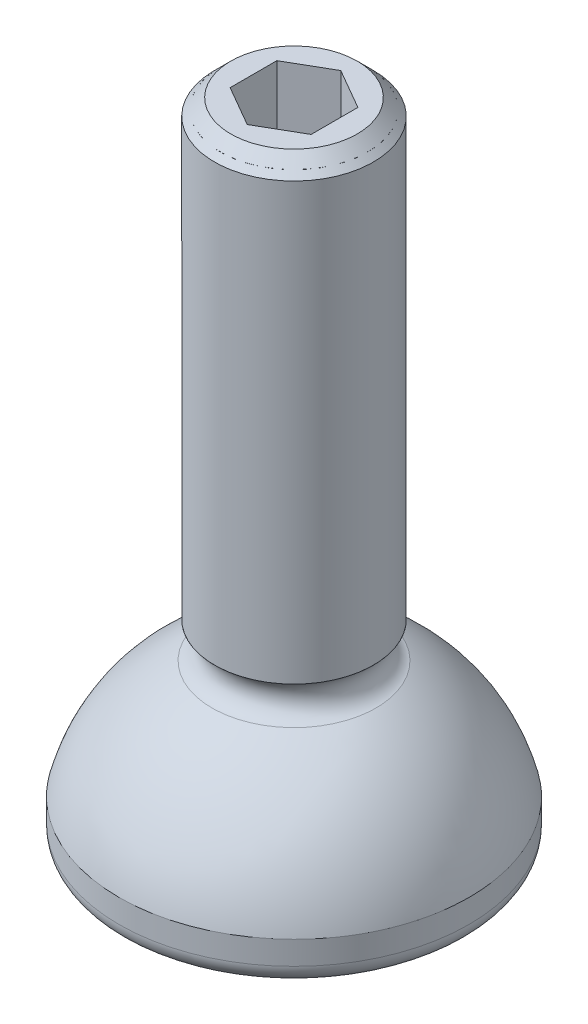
ISO-10303-21;
HEADER;
FILE_DESCRIPTION(('STEP AP214'),'2;1');
FILE_NAME('part.step','',(''),(''),'','','');
FILE_SCHEMA(('AUTOMOTIVE_DESIGN { 1 0 10303 214 1 1 1 1 }'));
ENDSEC;
DATA;
#1=APPLICATION_CONTEXT('core data for automotive mechanical design processes');
#2=APPLICATION_PROTOCOL_DEFINITION('international standard','automotive_design',2000,#1);
#3=PRODUCT_CONTEXT('',#1,'mechanical');
#4=PRODUCT('Part','Part','',(#3));
#5=PRODUCT_RELATED_PRODUCT_CATEGORY('part','',(#4));
#6=PRODUCT_DEFINITION_FORMATION('','',#4);
#7=PRODUCT_DEFINITION_CONTEXT('part definition',#1,'design');
#8=PRODUCT_DEFINITION('design','',#6,#7);
#9=PRODUCT_DEFINITION_SHAPE('','',#8);
#10=(LENGTH_UNIT() NAMED_UNIT(*) SI_UNIT(.MILLI.,.METRE.));
#11=(NAMED_UNIT(*) PLANE_ANGLE_UNIT() SI_UNIT($,.RADIAN.));
#12=(NAMED_UNIT(*) SI_UNIT($,.STERADIAN.) SOLID_ANGLE_UNIT());
#13=UNCERTAINTY_MEASURE_WITH_UNIT(LENGTH_MEASURE(1.E-05),#10,'distance_accuracy_value','');
#14=(GEOMETRIC_REPRESENTATION_CONTEXT(3) GLOBAL_UNCERTAINTY_ASSIGNED_CONTEXT((#13)) GLOBAL_UNIT_ASSIGNED_CONTEXT((#10,
#11,#12)) REPRESENTATION_CONTEXT('',''));
#15=CARTESIAN_POINT('',(0.,0.,0.));
#16=DIRECTION('',(0.,0.,1.));
#17=DIRECTION('',(1.,0.,0.));
#18=AXIS2_PLACEMENT_3D('',#15,#16,#17);
#19=CARTESIAN_POINT('',(0.,27.9400000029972,0.));
#20=DIRECTION('',(0.,-1.,0.));
#21=DIRECTION('',(0.,0.,-1.));
#22=AXIS2_PLACEMENT_3D('',#19,#20,#21);
#23=CYLINDRICAL_SURFACE('',#22,2.8829);
#24=CARTESIAN_POINT('',(0.,7.69088775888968,0.));
#25=DIRECTION('',(0.,-1.,0.));
#26=DIRECTION('',(0.,0.,-1.));
#27=AXIS2_PLACEMENT_3D('',#24,#25,#26);
#28=CIRCLE('',#27,2.8829);
#29=CARTESIAN_POINT('',(0.,7.69088775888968,-2.8829));
#30=VERTEX_POINT('',#29);
#31=EDGE_CURVE('P0_E21',#30,#30,#28,.F.);
#32=ORIENTED_EDGE('',*,*,#31,.T.);
#33=EDGE_LOOP('',(#32));
#34=FACE_BOUND('',#33,.T.);
#35=CARTESIAN_POINT('',(0.,24.9936,0.));
#36=DIRECTION('',(0.,-1.,0.));
#37=DIRECTION('',(0.,0.,-1.));
#38=AXIS2_PLACEMENT_3D('',#35,#36,#37);
#39=CIRCLE('',#38,2.8829);
#40=CARTESIAN_POINT('',(0.,24.9936,-2.8829));
#41=VERTEX_POINT('',#40);
#42=EDGE_CURVE('P0_E11',#41,#41,#39,.T.);
#43=ORIENTED_EDGE('',*,*,#42,.T.);
#44=EDGE_LOOP('',(#43));
#45=FACE_BOUND('',#44,.T.);
#46=ADVANCED_FACE('P0_F17',(#34,#45),#23,.T.);
#47=CARTESIAN_POINT('',(0.,7.69088775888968,0.));
#48=DIRECTION('',(0.,-1.,0.));
#49=DIRECTION('',(0.,0.,-1.));
#50=AXIS2_PLACEMENT_3D('',#47,#48,#49);
#51=PLANE('',#50);
#52=ORIENTED_EDGE('',*,*,#31,.F.);
#53=EDGE_LOOP('',(#52));
#54=FACE_BOUND('',#53,.T.);
#55=CARTESIAN_POINT('',(3.1115,7.69088775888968,0.));
#56=CARTESIAN_POINT('',(3.11129758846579,7.69088775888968,0.593742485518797));
#57=CARTESIAN_POINT('',(2.89303629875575,7.69088775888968,1.14532668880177));
#58=CARTESIAN_POINT('',(2.65612503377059,7.69088775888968,1.74404262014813));
#59=CARTESIAN_POINT('',(2.20016274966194,7.69088775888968,2.20016274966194));
#60=CARTESIAN_POINT('',(1.74494552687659,7.69088775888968,2.65553755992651));
#61=CARTESIAN_POINT('',(1.14532668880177,7.69088775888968,2.89303629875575));
#62=CARTESIAN_POINT('',(0.594021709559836,7.69088775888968,3.11139874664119));
#63=CARTESIAN_POINT('',(0.,7.69088775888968,3.1115));
#64=CARTESIAN_POINT('',(-0.592975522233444,7.69088775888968,3.11160107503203));
#65=CARTESIAN_POINT('',(-1.14532668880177,7.69088775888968,2.89303629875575));
#66=CARTESIAN_POINT('',(-1.74404262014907,7.69088775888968,2.65612503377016));
#67=CARTESIAN_POINT('',(-2.20016274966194,7.69088775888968,2.20016274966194));
#68=CARTESIAN_POINT('',(-2.65553755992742,7.69088775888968,1.74494552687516));
#69=CARTESIAN_POINT('',(-2.89303629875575,7.69088775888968,1.14532668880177));
#70=CARTESIAN_POINT('',(-3.11129740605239,7.69088775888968,0.59427756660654));
#71=CARTESIAN_POINT('',(-3.1115,7.69088775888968,0.));
#72=B_SPLINE_CURVE_WITH_KNOTS('',2,(#55,#56,#57,#58,#59,#60,#61,#62,#63,#64,#65,#66,#67,#68,#69,
#70,#71),.UNSPECIFIED.,.F.,.F.,(3,2,2,2,2,2,2,2,3),(0.,0.125,0.25,0.375,0.5,0.625,0.75,0.875,
1.),.UNSPECIFIED.);
#73=CARTESIAN_POINT('',(3.1115,7.69088775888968,0.));
#74=VERTEX_POINT('',#73);
#75=CARTESIAN_POINT('',(-3.1115,7.69088775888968,0.));
#76=VERTEX_POINT('',#75);
#77=EDGE_CURVE('P0_E29',#74,#76,#72,.T.);
#78=ORIENTED_EDGE('',*,*,#77,.F.);
#79=CARTESIAN_POINT('',(-3.1115,7.69088775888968,0.));
#80=CARTESIAN_POINT('',(-3.11129758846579,7.69088775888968,-0.593742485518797));
#81=CARTESIAN_POINT('',(-2.89303629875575,7.69088775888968,-1.14532668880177));
#82=CARTESIAN_POINT('',(-2.65612503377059,7.69088775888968,-1.74404262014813));
#83=CARTESIAN_POINT('',(-2.20016274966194,7.69088775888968,-2.20016274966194));
#84=CARTESIAN_POINT('',(-1.74494552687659,7.69088775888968,-2.65553755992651));
#85=CARTESIAN_POINT('',(-1.14532668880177,7.69088775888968,-2.89303629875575));
#86=CARTESIAN_POINT('',(-0.594021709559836,7.69088775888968,-3.11139874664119));
#87=CARTESIAN_POINT('',(0.,7.69088775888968,-3.1115));
#88=CARTESIAN_POINT('',(0.592975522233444,7.69088775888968,-3.11160107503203));
#89=CARTESIAN_POINT('',(1.14532668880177,7.69088775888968,-2.89303629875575));
#90=CARTESIAN_POINT('',(1.74404262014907,7.69088775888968,-2.65612503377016));
#91=CARTESIAN_POINT('',(2.20016274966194,7.69088775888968,-2.20016274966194));
#92=CARTESIAN_POINT('',(2.65553755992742,7.69088775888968,-1.74494552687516));
#93=CARTESIAN_POINT('',(2.89303629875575,7.69088775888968,-1.14532668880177));
#94=CARTESIAN_POINT('',(3.11129740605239,7.69088775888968,-0.59427756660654));
#95=CARTESIAN_POINT('',(3.1115,7.69088775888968,0.));
#96=B_SPLINE_CURVE_WITH_KNOTS('',2,(#79,#80,#81,#82,#83,#84,#85,#86,#87,#88,#89,#90,#91,#92,#93,
#94,#95),.UNSPECIFIED.,.F.,.F.,(3,2,2,2,2,2,2,2,3),(0.,0.125,0.25,0.375,0.5,0.625,0.75,0.875,
1.),.UNSPECIFIED.);
#97=EDGE_CURVE('P0_E33',#76,#74,#96,.T.);
#98=ORIENTED_EDGE('',*,*,#97,.F.);
#99=EDGE_LOOP('',(#78,#98));
#100=FACE_BOUND('',#99,.T.);
#101=ADVANCED_FACE('P0_F18',(#54,#100),#51,.F.);
#102=OPEN_SHELL('',(#46,#101));
#103=SHELL_BASED_SURFACE_MODEL('P0_B1',(#102));
#104=CARTESIAN_POINT('',(0.,20.5740000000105,0.));
#105=DIRECTION('',(0.,1.,0.));
#106=DIRECTION('',(0.,0.,1.));
#107=AXIS2_PLACEMENT_3D('',#104,#105,#106);
#108=CONICAL_SURFACE('',#107,1.58750000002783,1.02974425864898);
#109=CARTESIAN_POINT('',(1.4210854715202E-10,19.6201337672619,0.));
#110=VERTEX_POINT('',#109);
#111=VERTEX_LOOP('',#110);
#112=FACE_BOUND('',#111,.T.);
#113=CARTESIAN_POINT('',(0.,20.574,0.));
#114=DIRECTION('',(0.,1.,0.));
#115=DIRECTION('',(0.,0.,1.));
#116=AXIS2_PLACEMENT_3D('',#113,#114,#115);
#117=CIRCLE('',#116,1.5875);
#118=CARTESIAN_POINT('',(0.,20.574,1.5875));
#119=VERTEX_POINT('',#118);
#120=EDGE_CURVE('P1_E147',#119,#119,#117,.T.);
#121=ORIENTED_EDGE('',*,*,#120,.T.);
#122=EDGE_LOOP('',(#121));
#123=FACE_BOUND('',#122,.T.);
#124=ADVANCED_FACE('P1_F17',(#112,#123),#108,.F.);
#125=CARTESIAN_POINT('',(0.,19.331140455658,0.));
#126=DIRECTION('',(0.,1.,0.));
#127=DIRECTION('',(0.,0.,1.));
#128=AXIS2_PLACEMENT_3D('',#125,#126,#127);
#129=CYLINDRICAL_SURFACE('',#128,1.5875);
#130=ORIENTED_EDGE('',*,*,#120,.F.);
#131=EDGE_LOOP('',(#130));
#132=FACE_BOUND('',#131,.T.);
#133=CARTESIAN_POINT('',(0.,22.098,0.));
#134=DIRECTION('',(0.,1.,0.));
#135=DIRECTION('',(0.,0.,1.));
#136=AXIS2_PLACEMENT_3D('',#133,#134,#135);
#137=CIRCLE('',#136,1.5875);
#138=CARTESIAN_POINT('',(-1.5875,22.098,0.));
#139=VERTEX_POINT('',#138);
#140=CARTESIAN_POINT('',(-0.793749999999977,22.098,-1.37481532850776));
#141=VERTEX_POINT('',#140);
#142=EDGE_CURVE('P1_E126',#139,#141,#137,.F.);
#143=ORIENTED_EDGE('',*,*,#142,.F.);
#144=CARTESIAN_POINT('',(0.,22.098,0.));
#145=DIRECTION('',(0.,1.,0.));
#146=DIRECTION('',(0.,0.,1.));
#147=AXIS2_PLACEMENT_3D('',#144,#145,#146);
#148=CIRCLE('',#147,1.5875);
#149=CARTESIAN_POINT('',(-0.793749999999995,22.098,1.37481532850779));
#150=VERTEX_POINT('',#149);
#151=EDGE_CURVE('P1_E102',#150,#139,#148,.F.);
#152=ORIENTED_EDGE('',*,*,#151,.F.);
#153=CARTESIAN_POINT('',(0.,22.098,0.));
#154=DIRECTION('',(0.,1.,0.));
#155=DIRECTION('',(0.,0.,1.));
#156=AXIS2_PLACEMENT_3D('',#153,#154,#155);
#157=CIRCLE('',#156,1.5875);
#158=CARTESIAN_POINT('',(0.793749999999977,22.098,1.37481532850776));
#159=VERTEX_POINT('',#158);
#160=EDGE_CURVE('P1_E96',#159,#150,#157,.F.);
#161=ORIENTED_EDGE('',*,*,#160,.F.);
#162=CARTESIAN_POINT('',(0.,22.098,0.));
#163=DIRECTION('',(0.,1.,0.));
#164=DIRECTION('',(0.,0.,1.));
#165=AXIS2_PLACEMENT_3D('',#162,#163,#164);
#166=CIRCLE('',#165,1.5875);
#167=CARTESIAN_POINT('',(1.5875,22.098,0.));
#168=VERTEX_POINT('',#167);
#169=EDGE_CURVE('P1_E111',#168,#159,#166,.F.);
#170=ORIENTED_EDGE('',*,*,#169,.F.);
#171=CARTESIAN_POINT('',(0.,22.098,0.));
#172=DIRECTION('',(0.,1.,0.));
#173=DIRECTION('',(0.,0.,1.));
#174=AXIS2_PLACEMENT_3D('',#171,#172,#173);
#175=CIRCLE('',#174,1.5875);
#176=CARTESIAN_POINT('',(0.793749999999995,22.098,-1.37481532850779));
#177=VERTEX_POINT('',#176);
#178=EDGE_CURVE('P1_E137',#177,#168,#175,.F.);
#179=ORIENTED_EDGE('',*,*,#178,.F.);
#180=CARTESIAN_POINT('',(0.,22.098,0.));
#181=DIRECTION('',(0.,1.,0.));
#182=DIRECTION('',(0.,0.,1.));
#183=AXIS2_PLACEMENT_3D('',#180,#181,#182);
#184=CIRCLE('',#183,1.5875);
#185=EDGE_CURVE('P1_E133',#141,#177,#184,.F.);
#186=ORIENTED_EDGE('',*,*,#185,.F.);
#187=EDGE_LOOP('',(#143,#152,#161,#170,#179,#186));
#188=FACE_BOUND('',#187,.T.);
#189=ADVANCED_FACE('P1_F131',(#132,#188),#129,.F.);
#190=CARTESIAN_POINT('',(0.,0.,0.));
#191=DIRECTION('',(0.,-1.,0.));
#192=DIRECTION('',(0.,0.,-1.));
#193=AXIS2_PLACEMENT_3D('',#190,#191,#192);
#194=PLANE('',#193);
#195=CARTESIAN_POINT('',(0.,0.,0.));
#196=DIRECTION('',(0.,1.,0.));
#197=DIRECTION('',(-1.,0.,0.));
#198=AXIS2_PLACEMENT_3D('',#195,#196,#197);
#199=CIRCLE('',#198,6.096);
#200=CARTESIAN_POINT('',(-6.096,0.,0.));
#201=VERTEX_POINT('',#200);
#202=CARTESIAN_POINT('',(6.096,0.,0.));
#203=VERTEX_POINT('',#202);
#204=EDGE_CURVE('P1_E145',#201,#203,#199,.T.);
#205=ORIENTED_EDGE('',*,*,#204,.F.);
#206=CARTESIAN_POINT('',(0.,0.,0.));
#207=DIRECTION('',(0.,1.,0.));
#208=DIRECTION('',(1.,0.,0.));
#209=AXIS2_PLACEMENT_3D('',#206,#207,#208);
#210=CIRCLE('',#209,6.096);
#211=EDGE_CURVE('P1_E129',#203,#201,#210,.T.);
#212=ORIENTED_EDGE('',*,*,#211,.F.);
#213=EDGE_LOOP('',(#205,#212));
#214=FACE_BOUND('',#213,.T.);
#215=ADVANCED_FACE('P1_F156',(#214),#194,.T.);
#216=CARTESIAN_POINT('',(0.,22.098,0.));
#217=DIRECTION('',(0.,1.,0.));
#218=DIRECTION('',(0.,0.,1.));
#219=AXIS2_PLACEMENT_3D('',#216,#217,#218);
#220=PLANE('',#219);
#221=DIRECTION('',(0.866025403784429,0.,0.500000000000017));
#222=VECTOR('',#221,1.);
#223=CARTESIAN_POINT('',(-1.5875,22.098,0.91654355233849));
#224=LINE('',#223,#222);
#225=CARTESIAN_POINT('',(-1.5875,22.098,0.91654355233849));
#226=VERTEX_POINT('',#225);
#227=EDGE_CURVE('P1_E108',#226,#150,#224,.T.);
#228=ORIENTED_EDGE('',*,*,#227,.T.);
#229=ORIENTED_EDGE('',*,*,#151,.T.);
#230=DIRECTION('',(0.,0.,1.));
#231=VECTOR('',#230,1.);
#232=CARTESIAN_POINT('',(-1.5875,22.098,-0.91654355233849));
#233=LINE('',#232,#231);
#234=EDGE_CURVE('P1_E105',#139,#226,#233,.T.);
#235=ORIENTED_EDGE('',*,*,#234,.T.);
#236=EDGE_LOOP('',(#228,#229,#235));
#237=FACE_BOUND('',#236,.T.);
#238=ADVANCED_FACE('P1_F104',(#237),#220,.T.);
#239=CARTESIAN_POINT('',(0.,22.098,0.));
#240=DIRECTION('',(0.,1.,0.));
#241=DIRECTION('',(0.,0.,1.));
#242=AXIS2_PLACEMENT_3D('',#239,#240,#241);
#243=PLANE('',#242);
#244=DIRECTION('',(0.866025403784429,0.,-0.500000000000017));
#245=VECTOR('',#244,1.);
#246=CARTESIAN_POINT('',(0.,22.098,1.83308710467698));
#247=LINE('',#246,#245);
#248=CARTESIAN_POINT('',(0.,22.098,1.833087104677));
#249=VERTEX_POINT('',#248);
#250=EDGE_CURVE('P1_E307',#249,#159,#247,.T.);
#251=ORIENTED_EDGE('',*,*,#250,.T.);
#252=ORIENTED_EDGE('',*,*,#160,.T.);
#253=DIRECTION('',(0.866025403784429,0.,0.500000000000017));
#254=VECTOR('',#253,1.);
#255=CARTESIAN_POINT('',(-1.5875,22.098,0.91654355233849));
#256=LINE('',#255,#254);
#257=EDGE_CURVE('P1_E320',#150,#249,#256,.T.);
#258=ORIENTED_EDGE('',*,*,#257,.T.);
#259=EDGE_LOOP('',(#251,#252,#258));
#260=FACE_BOUND('',#259,.T.);
#261=ADVANCED_FACE('P1_F368',(#260),#243,.T.);
#262=CARTESIAN_POINT('',(0.,22.098,0.));
#263=DIRECTION('',(0.,1.,0.));
#264=DIRECTION('',(0.,0.,1.));
#265=AXIS2_PLACEMENT_3D('',#262,#263,#264);
#266=PLANE('',#265);
#267=DIRECTION('',(0.,0.,-1.));
#268=VECTOR('',#267,1.);
#269=CARTESIAN_POINT('',(1.5875,22.098,0.91654355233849));
#270=LINE('',#269,#268);
#271=CARTESIAN_POINT('',(1.58749999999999,22.098,0.91654355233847));
#272=VERTEX_POINT('',#271);
#273=EDGE_CURVE('P1_E289',#272,#168,#270,.T.);
#274=ORIENTED_EDGE('',*,*,#273,.T.);
#275=ORIENTED_EDGE('',*,*,#169,.T.);
#276=DIRECTION('',(0.866025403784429,0.,-0.500000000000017));
#277=VECTOR('',#276,1.);
#278=CARTESIAN_POINT('',(0.,22.098,1.83308710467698));
#279=LINE('',#278,#277);
#280=EDGE_CURVE('P1_E303',#159,#272,#279,.T.);
#281=ORIENTED_EDGE('',*,*,#280,.T.);
#282=EDGE_LOOP('',(#274,#275,#281));
#283=FACE_BOUND('',#282,.T.);
#284=ADVANCED_FACE('P1_F352',(#283),#266,.T.);
#285=CARTESIAN_POINT('',(0.,22.098,0.));
#286=DIRECTION('',(0.,1.,0.));
#287=DIRECTION('',(0.,0.,1.));
#288=AXIS2_PLACEMENT_3D('',#285,#286,#287);
#289=PLANE('',#288);
#290=DIRECTION('',(-0.866025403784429,0.,-0.500000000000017));
#291=VECTOR('',#290,1.);
#292=CARTESIAN_POINT('',(1.5875,22.098,-0.91654355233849));
#293=LINE('',#292,#291);
#294=CARTESIAN_POINT('',(1.5875,22.098,-0.91654355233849));
#295=VERTEX_POINT('',#294);
#296=EDGE_CURVE('P1_E266',#295,#177,#293,.T.);
#297=ORIENTED_EDGE('',*,*,#296,.T.);
#298=ORIENTED_EDGE('',*,*,#178,.T.);
#299=DIRECTION('',(0.,0.,-1.));
#300=VECTOR('',#299,1.);
#301=CARTESIAN_POINT('',(1.5875,22.098,0.91654355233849));
#302=LINE('',#301,#300);
#303=EDGE_CURVE('P1_E285',#168,#295,#302,.T.);
#304=ORIENTED_EDGE('',*,*,#303,.T.);
#305=EDGE_LOOP('',(#297,#298,#304));
#306=FACE_BOUND('',#305,.T.);
#307=ADVANCED_FACE('P1_F355',(#306),#289,.T.);
#308=CARTESIAN_POINT('',(0.,22.098,0.));
#309=DIRECTION('',(0.,1.,0.));
#310=DIRECTION('',(0.,0.,1.));
#311=AXIS2_PLACEMENT_3D('',#308,#309,#310);
#312=PLANE('',#311);
#313=DIRECTION('',(-0.866025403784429,0.,0.500000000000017));
#314=VECTOR('',#313,1.);
#315=CARTESIAN_POINT('',(0.,22.098,-1.83308710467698));
#316=LINE('',#315,#314);
#317=CARTESIAN_POINT('',(0.,22.098,-1.833087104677));
#318=VERTEX_POINT('',#317);
#319=EDGE_CURVE('P1_E248',#318,#141,#316,.T.);
#320=ORIENTED_EDGE('',*,*,#319,.T.);
#321=ORIENTED_EDGE('',*,*,#185,.T.);
#322=DIRECTION('',(-0.866025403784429,0.,-0.500000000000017));
#323=VECTOR('',#322,1.);
#324=CARTESIAN_POINT('',(1.5875,22.098,-0.91654355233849));
#325=LINE('',#324,#323);
#326=EDGE_CURVE('P1_E262',#177,#318,#325,.T.);
#327=ORIENTED_EDGE('',*,*,#326,.T.);
#328=EDGE_LOOP('',(#320,#321,#327));
#329=FACE_BOUND('',#328,.T.);
#330=ADVANCED_FACE('P1_F358',(#329),#312,.T.);
#331=CARTESIAN_POINT('',(0.,22.098,0.));
#332=DIRECTION('',(0.,1.,0.));
#333=DIRECTION('',(0.,0.,1.));
#334=AXIS2_PLACEMENT_3D('',#331,#332,#333);
#335=PLANE('',#334);
#336=DIRECTION('',(0.,0.,1.));
#337=VECTOR('',#336,1.);
#338=CARTESIAN_POINT('',(-1.5875,22.098,-0.91654355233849));
#339=LINE('',#338,#337);
#340=CARTESIAN_POINT('',(-1.58749999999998,22.098,-0.916543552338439));
#341=VERTEX_POINT('',#340);
#342=EDGE_CURVE('P1_E118',#341,#139,#339,.T.);
#343=ORIENTED_EDGE('',*,*,#342,.T.);
#344=ORIENTED_EDGE('',*,*,#142,.T.);
#345=DIRECTION('',(-0.866025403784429,0.,0.500000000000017));
#346=VECTOR('',#345,1.);
#347=CARTESIAN_POINT('',(0.,22.098,-1.83308710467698));
#348=LINE('',#347,#346);
#349=EDGE_CURVE('P1_E128',#141,#341,#348,.T.);
#350=ORIENTED_EDGE('',*,*,#349,.T.);
#351=EDGE_LOOP('',(#343,#344,#350));
#352=FACE_BOUND('',#351,.T.);
#353=ADVANCED_FACE('P1_F125',(#352),#335,.T.);
#354=CARTESIAN_POINT('',(0.,0.762,0.));
#355=DIRECTION('',(0.,-1.,0.));
#356=DIRECTION('',(0.999940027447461,0.,0.0109517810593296));
#357=AXIS2_PLACEMENT_3D('',#354,#355,#356);
#358=TOROIDAL_SURFACE('',#357,6.096,0.762);
#359=ORIENTED_EDGE('',*,*,#204,.T.);
#360=ORIENTED_EDGE('',*,*,#211,.T.);
#361=EDGE_LOOP('',(#359,#360));
#362=FACE_BOUND('',#361,.T.);
#363=CARTESIAN_POINT('',(0.,0.762,0.));
#364=DIRECTION('',(0.,-1.,0.));
#365=DIRECTION('',(0.,0.,-1.));
#366=AXIS2_PLACEMENT_3D('',#363,#364,#365);
#367=CIRCLE('',#366,6.858);
#368=CARTESIAN_POINT('',(0.,0.762,-6.858));
#369=VERTEX_POINT('',#368);
#370=EDGE_CURVE('P1_E243',#369,#369,#367,.F.);
#371=ORIENTED_EDGE('',*,*,#370,.F.);
#372=EDGE_LOOP('',(#371));
#373=FACE_BOUND('',#372,.T.);
#374=ADVANCED_FACE('P1_F150',(#362,#373),#358,.T.);
#375=CARTESIAN_POINT('',(-1.5875,25.4,-0.91654355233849));
#376=DIRECTION('',(-1.,0.,0.));
#377=DIRECTION('',(0.,0.,1.));
#378=AXIS2_PLACEMENT_3D('',#375,#376,#377);
#379=PLANE('',#378);
#380=ORIENTED_EDGE('',*,*,#234,.F.);
#381=ORIENTED_EDGE('',*,*,#342,.F.);
#382=DIRECTION('',(0.,1.,0.));
#383=VECTOR('',#382,1.);
#384=CARTESIAN_POINT('',(-1.58749999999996,25.4,-0.916543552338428));
#385=LINE('',#384,#383);
#386=CARTESIAN_POINT('',(-1.58749999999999,25.4,-0.916543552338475));
#387=VERTEX_POINT('',#386);
#388=EDGE_CURVE('P1_E247',#341,#387,#385,.T.);
#389=ORIENTED_EDGE('',*,*,#388,.T.);
#390=DIRECTION('',(0.,0.,-1.));
#391=VECTOR('',#390,1.);
#392=CARTESIAN_POINT('',(-1.5875,25.4,0.));
#393=LINE('',#392,#391);
#394=CARTESIAN_POINT('',(-1.5875,25.4,0.91654355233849));
#395=VERTEX_POINT('',#394);
#396=EDGE_CURVE('P1_E246',#387,#395,#393,.F.);
#397=ORIENTED_EDGE('',*,*,#396,.T.);
#398=DIRECTION('',(0.,1.,0.));
#399=VECTOR('',#398,1.);
#400=CARTESIAN_POINT('',(-1.5875,25.4,0.91654355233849));
#401=LINE('',#400,#399);
#402=EDGE_CURVE('P1_E121',#395,#226,#401,.F.);
#403=ORIENTED_EDGE('',*,*,#402,.T.);
#404=EDGE_LOOP('',(#380,#381,#389,#397,#403));
#405=FACE_BOUND('',#404,.T.);
#406=ADVANCED_FACE('P1_F116',(#405),#379,.F.);
#407=CARTESIAN_POINT('',(-1.5875,25.4,0.91654355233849));
#408=DIRECTION('',(-0.500000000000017,0.,0.866025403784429));
#409=DIRECTION('',(0.866025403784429,0.,0.500000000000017));
#410=AXIS2_PLACEMENT_3D('',#407,#408,#409);
#411=PLANE('',#410);
#412=ORIENTED_EDGE('',*,*,#257,.F.);
#413=ORIENTED_EDGE('',*,*,#227,.F.);
#414=ORIENTED_EDGE('',*,*,#402,.F.);
#415=DIRECTION('',(0.866025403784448,0.,0.499999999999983));
#416=VECTOR('',#415,1.);
#417=CARTESIAN_POINT('',(-1.5875,25.4,0.91654355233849));
#418=LINE('',#417,#416);
#419=CARTESIAN_POINT('',(0.,25.4,1.83308710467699));
#420=VERTEX_POINT('',#419);
#421=EDGE_CURVE('P1_E311',#395,#420,#418,.T.);
#422=ORIENTED_EDGE('',*,*,#421,.T.);
#423=DIRECTION('',(0.,1.,0.));
#424=VECTOR('',#423,1.);
#425=CARTESIAN_POINT('',(0.,25.4,1.83308710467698));
#426=LINE('',#425,#424);
#427=EDGE_CURVE('P1_E315',#420,#249,#426,.F.);
#428=ORIENTED_EDGE('',*,*,#427,.T.);
#429=EDGE_LOOP('',(#412,#413,#414,#422,#428));
#430=FACE_BOUND('',#429,.T.);
#431=ADVANCED_FACE('P1_F229',(#430),#411,.F.);
#432=CARTESIAN_POINT('',(0.,25.4,1.83308710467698));
#433=DIRECTION('',(0.500000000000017,0.,0.866025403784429));
#434=DIRECTION('',(0.866025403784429,0.,-0.500000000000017));
#435=AXIS2_PLACEMENT_3D('',#432,#433,#434);
#436=PLANE('',#435);
#437=ORIENTED_EDGE('',*,*,#280,.F.);
#438=ORIENTED_EDGE('',*,*,#250,.F.);
#439=ORIENTED_EDGE('',*,*,#427,.F.);
#440=DIRECTION('',(0.866025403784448,0.,-0.499999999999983));
#441=VECTOR('',#440,1.);
#442=CARTESIAN_POINT('',(0.,25.4,1.83308710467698));
#443=LINE('',#442,#441);
#444=CARTESIAN_POINT('',(1.5875,25.4,0.916543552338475));
#445=VERTEX_POINT('',#444);
#446=EDGE_CURVE('P1_E293',#420,#445,#443,.T.);
#447=ORIENTED_EDGE('',*,*,#446,.T.);
#448=DIRECTION('',(0.,1.,0.));
#449=VECTOR('',#448,1.);
#450=CARTESIAN_POINT('',(1.5875,25.4,0.91654355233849));
#451=LINE('',#450,#449);
#452=EDGE_CURVE('P1_E298',#445,#272,#451,.F.);
#453=ORIENTED_EDGE('',*,*,#452,.T.);
#454=EDGE_LOOP('',(#437,#438,#439,#447,#453));
#455=FACE_BOUND('',#454,.T.);
#456=ADVANCED_FACE('P1_F225',(#455),#436,.F.);
#457=CARTESIAN_POINT('',(1.5875,25.4,0.91654355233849));
#458=DIRECTION('',(1.,0.,0.));
#459=DIRECTION('',(0.,0.,-1.));
#460=AXIS2_PLACEMENT_3D('',#457,#458,#459);
#461=PLANE('',#460);
#462=ORIENTED_EDGE('',*,*,#303,.F.);
#463=ORIENTED_EDGE('',*,*,#273,.F.);
#464=ORIENTED_EDGE('',*,*,#452,.F.);
#465=DIRECTION('',(0.,0.,-1.));
#466=VECTOR('',#465,1.);
#467=CARTESIAN_POINT('',(1.5875,25.4,0.));
#468=LINE('',#467,#466);
#469=CARTESIAN_POINT('',(1.5875,25.4,-0.91654355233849));
#470=VERTEX_POINT('',#469);
#471=EDGE_CURVE('P1_E271',#445,#470,#468,.T.);
#472=ORIENTED_EDGE('',*,*,#471,.T.);
#473=DIRECTION('',(0.,1.,0.));
#474=VECTOR('',#473,1.);
#475=CARTESIAN_POINT('',(1.5875,25.4,-0.91654355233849));
#476=LINE('',#475,#474);
#477=EDGE_CURVE('P1_E280',#470,#295,#476,.F.);
#478=ORIENTED_EDGE('',*,*,#477,.T.);
#479=EDGE_LOOP('',(#462,#463,#464,#472,#478));
#480=FACE_BOUND('',#479,.T.);
#481=ADVANCED_FACE('P1_F222',(#480),#461,.F.);
#482=CARTESIAN_POINT('',(1.5875,25.4,-0.91654355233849));
#483=DIRECTION('',(0.500000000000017,0.,-0.866025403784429));
#484=DIRECTION('',(-0.866025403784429,0.,-0.500000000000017));
#485=AXIS2_PLACEMENT_3D('',#482,#483,#484);
#486=PLANE('',#485);
#487=ORIENTED_EDGE('',*,*,#326,.F.);
#488=ORIENTED_EDGE('',*,*,#296,.F.);
#489=ORIENTED_EDGE('',*,*,#477,.F.);
#490=DIRECTION('',(-0.866025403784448,0.,-0.499999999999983));
#491=VECTOR('',#490,1.);
#492=CARTESIAN_POINT('',(1.5875,25.4,-0.91654355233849));
#493=LINE('',#492,#491);
#494=CARTESIAN_POINT('',(0.,25.4,-1.83308710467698));
#495=VERTEX_POINT('',#494);
#496=EDGE_CURVE('P1_E37',#470,#495,#493,.T.);
#497=ORIENTED_EDGE('',*,*,#496,.T.);
#498=DIRECTION('',(0.,1.,0.));
#499=VECTOR('',#498,1.);
#500=CARTESIAN_POINT('',(0.,25.4,-1.83308710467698));
#501=LINE('',#500,#499);
#502=EDGE_CURVE('P1_E250',#495,#318,#501,.F.);
#503=ORIENTED_EDGE('',*,*,#502,.T.);
#504=EDGE_LOOP('',(#487,#488,#489,#497,#503));
#505=FACE_BOUND('',#504,.T.);
#506=ADVANCED_FACE('P1_F218',(#505),#486,.F.);
#507=CARTESIAN_POINT('',(0.,25.4,-1.83308710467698));
#508=DIRECTION('',(-0.500000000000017,0.,-0.866025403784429));
#509=DIRECTION('',(-0.866025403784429,0.,0.500000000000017));
#510=AXIS2_PLACEMENT_3D('',#507,#508,#509);
#511=PLANE('',#510);
#512=ORIENTED_EDGE('',*,*,#349,.F.);
#513=ORIENTED_EDGE('',*,*,#319,.F.);
#514=ORIENTED_EDGE('',*,*,#502,.F.);
#515=DIRECTION('',(-0.866025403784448,0.,0.499999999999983));
#516=VECTOR('',#515,1.);
#517=CARTESIAN_POINT('',(0.,25.4,-1.83308710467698));
#518=LINE('',#517,#516);
#519=EDGE_CURVE('P1_E270',#495,#387,#518,.T.);
#520=ORIENTED_EDGE('',*,*,#519,.T.);
#521=ORIENTED_EDGE('',*,*,#388,.F.);
#522=EDGE_LOOP('',(#512,#513,#514,#520,#521));
#523=FACE_BOUND('',#522,.T.);
#524=ADVANCED_FACE('P1_F214',(#523),#511,.F.);
#525=CARTESIAN_POINT('',(0.,0.,0.));
#526=DIRECTION('',(0.,-1.,0.));
#527=DIRECTION('',(0.,0.,-1.));
#528=AXIS2_PLACEMENT_3D('',#525,#526,#527);
#529=CYLINDRICAL_SURFACE('',#528,6.858);
#530=CARTESIAN_POINT('',(0.,1.68177924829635,0.));
#531=DIRECTION('',(0.,-1.,0.));
#532=DIRECTION('',(0.,0.,-1.));
#533=AXIS2_PLACEMENT_3D('',#530,#531,#532);
#534=CIRCLE('',#533,6.858);
#535=CARTESIAN_POINT('',(0.,1.68177924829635,-6.858));
#536=VERTEX_POINT('',#535);
#537=EDGE_CURVE('P1_E140',#536,#536,#534,.F.);
#538=ORIENTED_EDGE('',*,*,#537,.F.);
#539=EDGE_LOOP('',(#538));
#540=FACE_BOUND('',#539,.T.);
#541=ORIENTED_EDGE('',*,*,#370,.T.);
#542=EDGE_LOOP('',(#541));
#543=FACE_BOUND('',#542,.T.);
#544=ADVANCED_FACE('P1_F210',(#540,#543),#529,.T.);
#545=CARTESIAN_POINT('',(0.,25.4,0.));
#546=DIRECTION('',(0.,-1.,0.));
#547=DIRECTION('',(0.,0.,-1.));
#548=AXIS2_PLACEMENT_3D('',#545,#546,#547);
#549=PLANE('',#548);
#550=ORIENTED_EDGE('',*,*,#496,.F.);
#551=ORIENTED_EDGE('',*,*,#471,.F.);
#552=ORIENTED_EDGE('',*,*,#446,.F.);
#553=ORIENTED_EDGE('',*,*,#421,.F.);
#554=ORIENTED_EDGE('',*,*,#396,.F.);
#555=ORIENTED_EDGE('',*,*,#519,.F.);
#556=EDGE_LOOP('',(#550,#551,#552,#553,#554,#555));
#557=FACE_BOUND('',#556,.T.);
#558=CARTESIAN_POINT('',(0.,25.3999999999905,0.));
#559=DIRECTION('',(0.,-1.,0.));
#560=DIRECTION('',(0.,0.,-1.));
#561=AXIS2_PLACEMENT_3D('',#558,#559,#560);
#562=CIRCLE('',#561,2.47650000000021);
#563=CARTESIAN_POINT('',(0.,25.3999999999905,-2.47650000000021));
#564=VERTEX_POINT('',#563);
#565=EDGE_CURVE('P1_E464',#564,#564,#562,.T.);
#566=ORIENTED_EDGE('',*,*,#565,.F.);
#567=EDGE_LOOP('',(#566));
#568=FACE_BOUND('',#567,.T.);
#569=ADVANCED_FACE('P1_F206',(#557,#568),#549,.F.);
#570=CARTESIAN_POINT('',(0.,0.,0.));
#571=DIRECTION('',(-1.,0.,0.));
#572=DIRECTION('',(0.,0.,-1.));
#573=AXIS2_PLACEMENT_3D('',#570,#571,#572);
#574=SPHERICAL_SURFACE('',#573,7.0612);
#575=ORIENTED_EDGE('',*,*,#537,.T.);
#576=EDGE_LOOP('',(#575));
#577=FACE_BOUND('',#576,.T.);
#578=CARTESIAN_POINT('',(0.,6.2872531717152,0.));
#579=DIRECTION('',(0.,-1.,0.));
#580=DIRECTION('',(-1.,0.,0.));
#581=AXIS2_PLACEMENT_3D('',#578,#579,#580);
#582=CIRCLE('',#581,3.21418621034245);
#583=CARTESIAN_POINT('',(-3.21418621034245,6.2872531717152,0.));
#584=VERTEX_POINT('',#583);
#585=EDGE_CURVE('P1_E465',#584,#584,#582,.T.);
#586=ORIENTED_EDGE('',*,*,#585,.T.);
#587=EDGE_LOOP('',(#586));
#588=FACE_BOUND('',#587,.T.);
#589=ADVANCED_FACE('P1_F203',(#577,#588),#574,.T.);
#590=CARTESIAN_POINT('',(0.,24.7650000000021,0.));
#591=DIRECTION('',(0.,-1.,0.));
#592=DIRECTION('',(0.,0.,-1.));
#593=AXIS2_PLACEMENT_3D('',#590,#591,#592);
#594=CONICAL_SURFACE('',#593,3.11149999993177,0.78539816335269);
#595=CARTESIAN_POINT('',(0.,24.765,0.));
#596=DIRECTION('',(0.,-1.,0.));
#597=DIRECTION('',(0.,0.,-1.));
#598=AXIS2_PLACEMENT_3D('',#595,#596,#597);
#599=CIRCLE('',#598,3.1115);
#600=CARTESIAN_POINT('',(0.,24.765,-3.1115));
#601=VERTEX_POINT('',#600);
#602=EDGE_CURVE('P1_E28',#601,#601,#599,.T.);
#603=ORIENTED_EDGE('',*,*,#602,.F.);
#604=EDGE_LOOP('',(#603));
#605=FACE_BOUND('',#604,.T.);
#606=ORIENTED_EDGE('',*,*,#565,.T.);
#607=EDGE_LOOP('',(#606));
#608=FACE_BOUND('',#607,.T.);
#609=ADVANCED_FACE('P1_F191',(#605,#608),#594,.T.);
#610=CARTESIAN_POINT('',(0.,7.0104,0.));
#611=DIRECTION('',(0.,-1.,0.));
#612=DIRECTION('',(-1.,0.,0.));
#613=AXIS2_PLACEMENT_3D('',#610,#611,#612);
#614=TOROIDAL_SURFACE('',#613,3.4544,0.762);
#615=ORIENTED_EDGE('',*,*,#585,.F.);
#616=EDGE_LOOP('',(#615));
#617=FACE_BOUND('',#616,.T.);
#618=CARTESIAN_POINT('',(0.,7.69088775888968,0.));
#619=DIRECTION('',(0.,-1.,0.));
#620=DIRECTION('',(0.,0.,-1.));
#621=AXIS2_PLACEMENT_3D('',#618,#619,#620);
#622=CIRCLE('',#621,3.1115);
#623=CARTESIAN_POINT('',(0.,7.69088775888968,-3.1115));
#624=VERTEX_POINT('',#623);
#625=EDGE_CURVE('P1_E11',#624,#624,#622,.F.);
#626=ORIENTED_EDGE('',*,*,#625,.F.);
#627=EDGE_LOOP('',(#626));
#628=FACE_BOUND('',#627,.T.);
#629=ADVANCED_FACE('P1_F185',(#617,#628),#614,.F.);
#630=CARTESIAN_POINT('',(0.,0.,0.));
#631=DIRECTION('',(0.,-1.,0.));
#632=DIRECTION('',(0.,0.,-1.));
#633=AXIS2_PLACEMENT_3D('',#630,#631,#632);
#634=CYLINDRICAL_SURFACE('',#633,3.1115);
#635=ORIENTED_EDGE('',*,*,#602,.T.);
#636=EDGE_LOOP('',(#635));
#637=FACE_BOUND('',#636,.T.);
#638=ORIENTED_EDGE('',*,*,#625,.T.);
#639=EDGE_LOOP('',(#638));
#640=FACE_BOUND('',#639,.T.);
#641=ADVANCED_FACE('P1_F183',(#637,#640),#634,.T.);
#642=CLOSED_SHELL('',(#124,#189,#215,#238,#261,#284,#307,#330,#353,#374,#406,#431,#456,#481,
#506,#524,#544,#569,#589,#609,#629,#641));
#643=MANIFOLD_SOLID_BREP('P1_B1',#642);
#644=ADVANCED_BREP_SHAPE_REPRESENTATION('',(#18,#643),#14);
#645=MANIFOLD_SURFACE_SHAPE_REPRESENTATION('',(#18,#103),#14);
#646=SHAPE_REPRESENTATION('',(#18),#14);
#647=SHAPE_DEFINITION_REPRESENTATION(#9,#646);
#648=SHAPE_REPRESENTATION_RELATIONSHIP('','',#646,#644);
#649=SHAPE_REPRESENTATION_RELATIONSHIP('','',#646,#645);
ENDSEC;
END-ISO-10303-21;
